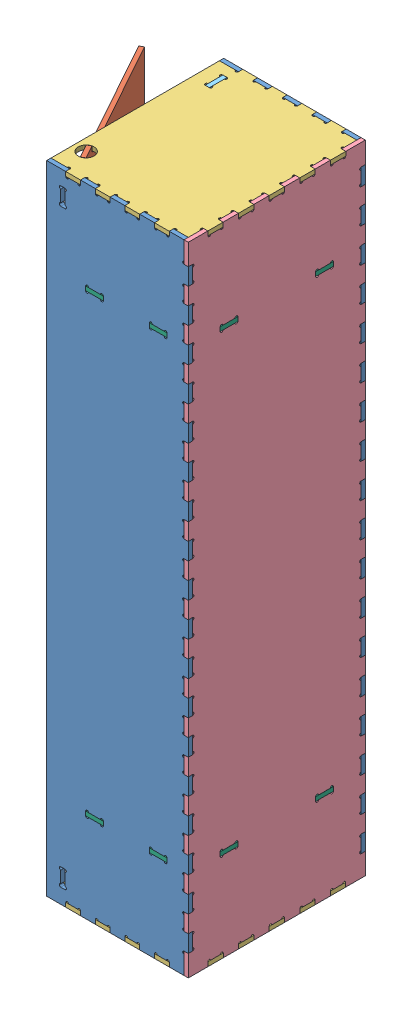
SolidWorks assembly assembly.sldasm, configuration Default (file format 6000). Lengths in mm.
Overall size (580.46 1800 500).
10 component instances, 6 part files, 21 mates.
Components (placement in the parent):
- side-1: side.sldprt [По умолчанию] at (-1089.6305 1305.9567 1794) size (400 1800 12)
- door-2: door.sldprt [По умолчанию] at (-933.8474 646.7567 2321.0548) x (0 -1 0) z (0.874892 0 -0.484318) size (1800 464 44.91)
- top-bottom-1: top-bottom.sldprt [По умолчанию] at (-1088.8125 781.9567 1818.0143) x (1 0 0) z (0 -1 0) size (400 500 12)
- back-1: back.sldprt [По умолчанию] at (-888.8125 993.9567 1818) x (0 -1 0) z (-1 0 0) size (1800 500 12)
- side-2: side.sldprt [По умолчанию] at (-1089.6305 1305.9567 1306) size (400 1800 12)
- top-bottom-2: top-bottom.sldprt [По умолчанию] at (-1088.8125 -1006.0433 1818.0143) x (1 0 0) z (0 -1 0) size (400 500 12)
- corner-1: corner.sldprt [По умолчанию] at (-1249.1725 781.9567 1398) x (1 0 0) z (0 0 -1) size (12 92 92)
- corner-2: corner.sldprt [По умолчанию] at (-1249.3725 -926.0433 1306) x (1 0 0) z (0 -1 0) size (12 92 92)
- partition-1: partition.sldprt [По умолчанию] at (-900.8125 -766.4433 1556) x (0 0 -1) z (1 0 0) size (500 12 332)
- partition-2: partition.sldprt [По умолчанию] at (-900.8125 518.1567 1556) x (0 0 -1) z (1 0 0) size (500 12 332)
Mates (geometry in assembly coordinates):
- Coincident1: coincident aligned: plane of side-1 through (-1089.6305 1305.9567 1806) normal (0 0 1); plane of top-bottom-1 through (-1193.2565 769.9567 1806) normal (0 0 1)
- Coincident2: coincident aligned: plane of side-1 through (-1235.0345 781.9567 1806) normal (0 1 0); plane of top-bottom-1 through (-1088.8125 781.9567 1818.0143) normal (0 1 0)
- Coincident3: coincident aligned: plane of side-1 through (-1288.8125 781.9567 1806) normal (-1 0 0); plane of top-bottom-1 through (-1288.8125 769.9567 1794) normal (-1 0 0)
- Coincident4: coincident aligned: plane of side-1 through (-1089.6305 1305.9567 1806) normal (0 0 1); plane of back-1 through (-900.8125 721.9567 1806) normal (0 0 1)
- Coincident5: coincident aligned: plane of top-bottom-1 through (-1088.8125 781.9567 1818.0143) normal (0 1 0); plane of back-1 through (-900.8125 781.9567 1806) normal (0 1 0)
- Coincident6: coincident aligned: plane of side-1 through (-888.8125 289.7567 1806) normal (1 0 0); plane of back-1 through (-888.8125 993.9567 1818) normal (1 0 0)
- Coincident10: coincident aligned: plane of door-2 through (-1260.4058 781.9567 1706.3688) normal (0 1 0); plane of top-bottom-1 through (-1088.8125 781.9567 1818.0143) normal (0 1 0)
- Concentric2: concentric aligned: circle of door-2; circle of top-bottom-1
- Coincident11: coincident aligned: plane of top-bottom-1 through (-1088.8125 781.9567 1818.0143) normal (0 1 0); plane of corner-1 through (-1237.1725 781.9567 1398) normal (0 1 0)
- Parallel2: parallel aligned: plane of back-1 through (-888.8125 993.9567 1818) normal (1 0 0); plane of corner-1 through (-1237.1725 769.9567 1343.9) normal (1 0 0)
- Coincident13: coincident aligned: plane of side-2 through (-1089.6305 1305.9567 1306) normal (0 0 -1); plane of corner-1 through (-1237.1725 739.9567 1306) normal (0 0 -1)
- Coincident15: coincident anti-aligned: plane of side-2 through (-1249.1725 731.7567 1318) normal (1 0 0); plane of corner-1 through (-1249.1725 769.9567 1343.9) normal (-1 0 0)
- Coincident16: coincident aligned: plane of side-2 through (-1089.6305 1305.9567 1306) normal (0 0 -1); plane of corner-2 through (-1237.3725 -926.0433 1306) normal (0 0 -1)
- Coincident17: coincident anti-aligned: plane of side-2 through (-1237.3725 -967.8433 1318) normal (-1 0 0); plane of corner-2 through (-1237.3725 -980.1433 1318) normal (1 0 0)
- Coincident18: coincident aligned: plane of top-bottom-2 through (-1088.8125 -1018.0433 1818.0143) normal (0 -1 0); plane of corner-2 through (-1237.3725 -1018.0433 1348) normal (0 -1 0)
- Coincident20: coincident aligned: plane of side-1 through (-1089.6305 1305.9567 1806) normal (0 0 1); plane of partition-1 through (-1128.8125 -754.4433 1806) normal (0 0 1)
- Coincident21: coincident aligned: plane of back-1 through (-888.8125 993.9567 1818) normal (1 0 0); plane of partition-1 through (-888.8125 -754.4433 1666) normal (1 0 0)
- Coincident22: coincident anti-aligned: plane of side-1 through (-990.6125 -754.4433 1806) normal (0 -1 0); plane of partition-1 through (-900.8125 -754.4433 1450.1) normal (0 1 0)
- Coincident23: coincident anti-aligned: plane of side-2 through (-1170.6125 530.1567 1318) normal (0 -1 0); plane of partition-2 through (-900.8125 530.1567 1450.1) normal (0 1 0)
- Coincident24: coincident aligned: plane of side-1 through (-1089.6305 1305.9567 1806) normal (0 0 1); plane of partition-2 through (-1128.8125 530.1567 1806) normal (0 0 1)
- Coincident25: coincident aligned: plane of back-1 through (-888.8125 993.9567 1818) normal (1 0 0); plane of partition-2 through (-888.8125 530.1567 1666) normal (1 0 0)
